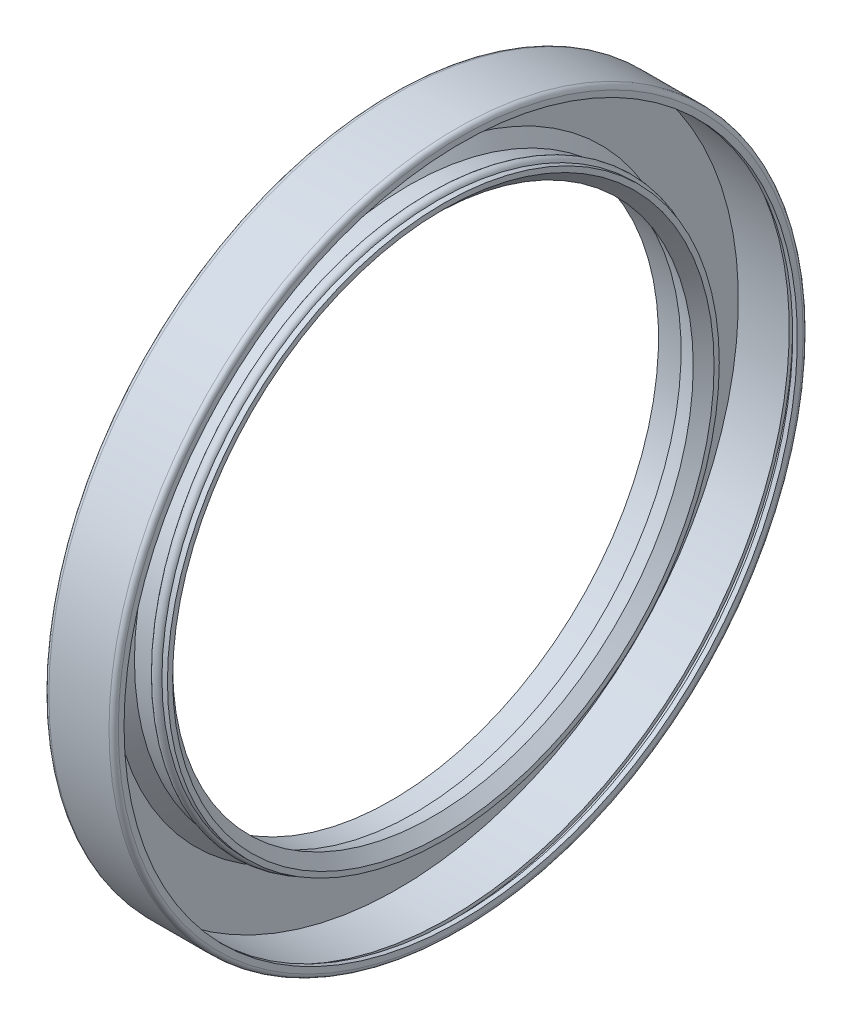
from build123d import *


with BuildPart() as part:
    # Esquisse1 → Base-R_volution (revolve)
    with BuildSketch(Plane(origin=(0, 0, 0), x_dir=(1, 0, 0), z_dir=(0, 1, 0)), mode=Mode.PRIVATE) as base_r_volution_sk:
        with BuildLine():
            Line((0, 30.8), (0, 39.466666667))
            ThreePointArc((0, 39.466666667), (0.156209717, 39.843790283), (0.533333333, 40))
            Line((0.533333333, 40), (7.466666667, 40))
            ThreePointArc((7.466666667, 40), (7.843790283, 39.843790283), (8, 39.466666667))
            Line((8, 39.466666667), (8, 38.8))
            Line((8, 38.8), (7.466666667, 38.8))
            Line((7.466666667, 38.8), (7.466666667, 39.6))
            Line((7.466666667, 39.6), (6.666666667, 39.6))
            Line((6.666666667, 39.6), (6.666666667, 39.2))
            Line((6.666666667, 39.2), (0.8, 39.2))
            Line((0.8, 39.2), (0.8, 33.030104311))
            Line((0.8, 33.030104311), (2, 31.6))
            Line((2, 31.6), (4.2, 31.6))
            ThreePointArc((4.2, 31.6), (4.698538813, 32.191359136), (5.365685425, 31.8))
            Line((5.365685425, 31.8), (6, 31.8))
            Line((6, 31.8), (6, 31.2))
            Line((6, 31.2), (4.8, 30))
            Line((4.8, 30), (2.602018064, 30.8))
            Line((2.602018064, 30.8), (0, 30.8))
        make_face()
    revolve(base_r_volution_sk.sketch.rotate(Axis((0, 0, 0), (1, 0, 0)), 180), axis=Axis((0, 0, 0), (1, 0, 0)))


solid = part.part
